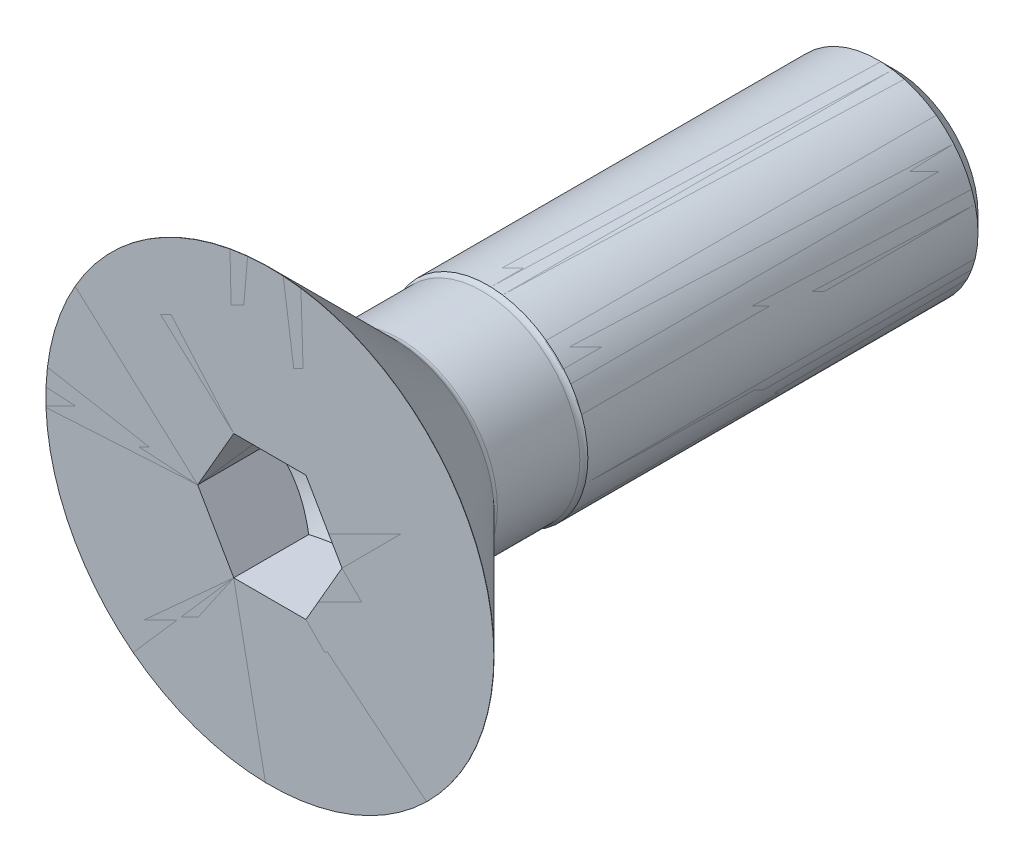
ISO-10303-21;
HEADER;
FILE_DESCRIPTION(('STEP AP214'),'2;1');
FILE_NAME('part.step','',(''),(''),'','','');
FILE_SCHEMA(('AUTOMOTIVE_DESIGN { 1 0 10303 214 1 1 1 1 }'));
ENDSEC;
DATA;
#1=APPLICATION_CONTEXT('core data for automotive mechanical design processes');
#2=APPLICATION_PROTOCOL_DEFINITION('international standard','automotive_design',2000,#1);
#3=PRODUCT_CONTEXT('',#1,'mechanical');
#4=PRODUCT('Part','Part','',(#3));
#5=PRODUCT_RELATED_PRODUCT_CATEGORY('part','',(#4));
#6=PRODUCT_DEFINITION_FORMATION('','',#4);
#7=PRODUCT_DEFINITION_CONTEXT('part definition',#1,'design');
#8=PRODUCT_DEFINITION('design','',#6,#7);
#9=PRODUCT_DEFINITION_SHAPE('','',#8);
#10=(LENGTH_UNIT() NAMED_UNIT(*) SI_UNIT(.MILLI.,.METRE.));
#11=(NAMED_UNIT(*) PLANE_ANGLE_UNIT() SI_UNIT($,.RADIAN.));
#12=(NAMED_UNIT(*) SI_UNIT($,.STERADIAN.) SOLID_ANGLE_UNIT());
#13=UNCERTAINTY_MEASURE_WITH_UNIT(LENGTH_MEASURE(1.E-05),#10,'distance_accuracy_value','');
#14=(GEOMETRIC_REPRESENTATION_CONTEXT(3) GLOBAL_UNCERTAINTY_ASSIGNED_CONTEXT((#13)) GLOBAL_UNIT_ASSIGNED_CONTEXT((#10,
#11,#12)) REPRESENTATION_CONTEXT('',''));
#15=CARTESIAN_POINT('',(0.,0.,0.));
#16=DIRECTION('',(0.,0.,1.));
#17=DIRECTION('',(1.,0.,0.));
#18=AXIS2_PLACEMENT_3D('',#15,#16,#17);
#19=CARTESIAN_POINT('',(0.,8.96,0.));
#20=DIRECTION('',(0.,0.,-1.));
#21=DIRECTION('',(-1.,0.,0.));
#22=AXIS2_PLACEMENT_3D('',#19,#20,#21);
#23=PLANE('',#22);
#24=CARTESIAN_POINT('',(0.,0.,0.));
#25=DIRECTION('',(0.,0.,1.));
#26=DIRECTION('',(1.,0.,0.));
#27=AXIS2_PLACEMENT_3D('',#24,#25,#26);
#28=CIRCLE('',#27,8.96);
#29=CARTESIAN_POINT('',(8.96,0.,0.));
#30=VERTEX_POINT('',#29);
#31=EDGE_CURVE('P0_E118',#30,#30,#28,.T.);
#32=ORIENTED_EDGE('',*,*,#31,.T.);
#33=EDGE_LOOP('',(#32));
#34=FACE_BOUND('',#33,.T.);
#35=DIRECTION('',(0.5,-0.866025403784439,0.));
#36=VECTOR('',#35,1.);
#37=CARTESIAN_POINT('',(1.443375,2.49999883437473,0.));
#38=LINE('',#37,#36);
#39=CARTESIAN_POINT('',(1.443375,2.49999883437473,0.));
#40=VERTEX_POINT('',#39);
#41=CARTESIAN_POINT('',(2.88675,0.,0.));
#42=VERTEX_POINT('',#41);
#43=EDGE_CURVE('P0_E42',#40,#42,#38,.T.);
#44=ORIENTED_EDGE('',*,*,#43,.T.);
#45=DIRECTION('',(-0.5,-0.866025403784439,0.));
#46=VECTOR('',#45,1.);
#47=CARTESIAN_POINT('',(2.88675,0.,0.));
#48=LINE('',#47,#46);
#49=CARTESIAN_POINT('',(1.443375,-2.49999883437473,0.));
#50=VERTEX_POINT('',#49);
#51=EDGE_CURVE('P0_E191',#42,#50,#48,.T.);
#52=ORIENTED_EDGE('',*,*,#51,.T.);
#53=DIRECTION('',(-1.,0.,0.));
#54=VECTOR('',#53,1.);
#55=CARTESIAN_POINT('',(1.443375,-2.49999883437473,0.));
#56=LINE('',#55,#54);
#57=CARTESIAN_POINT('',(-1.443375,-2.49999883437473,0.));
#58=VERTEX_POINT('',#57);
#59=EDGE_CURVE('P0_E242',#50,#58,#56,.T.);
#60=ORIENTED_EDGE('',*,*,#59,.T.);
#61=DIRECTION('',(-0.5,0.866025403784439,0.));
#62=VECTOR('',#61,1.);
#63=CARTESIAN_POINT('',(-1.443375,-2.49999883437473,0.));
#64=LINE('',#63,#62);
#65=CARTESIAN_POINT('',(-2.88675,0.,0.));
#66=VERTEX_POINT('',#65);
#67=EDGE_CURVE('P0_E240',#58,#66,#64,.T.);
#68=ORIENTED_EDGE('',*,*,#67,.T.);
#69=DIRECTION('',(0.5,0.866025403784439,0.));
#70=VECTOR('',#69,1.);
#71=CARTESIAN_POINT('',(-2.88675,0.,0.));
#72=LINE('',#71,#70);
#73=CARTESIAN_POINT('',(-1.443375,2.49999883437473,0.));
#74=VERTEX_POINT('',#73);
#75=EDGE_CURVE('P0_E107',#66,#74,#72,.T.);
#76=ORIENTED_EDGE('',*,*,#75,.T.);
#77=DIRECTION('',(1.,0.,0.));
#78=VECTOR('',#77,1.);
#79=CARTESIAN_POINT('',(-1.443375,2.49999883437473,0.));
#80=LINE('',#79,#78);
#81=EDGE_CURVE('P0_E103',#74,#40,#80,.T.);
#82=ORIENTED_EDGE('',*,*,#81,.T.);
#83=EDGE_LOOP('',(#44,#52,#60,#68,#76,#82));
#84=FACE_BOUND('',#83,.T.);
#85=ADVANCED_FACE('P0_F28',(#34,#84),#23,.F.);
#86=CARTESIAN_POINT('',(0.,0.,-25.));
#87=DIRECTION('',(0.,0.,1.));
#88=DIRECTION('',(1.,0.,0.));
#89=AXIS2_PLACEMENT_3D('',#86,#87,#88);
#90=PLANE('',#89);
#91=CARTESIAN_POINT('',(0.,0.,-25.));
#92=DIRECTION('',(0.,0.,1.));
#93=DIRECTION('',(1.,0.,0.));
#94=AXIS2_PLACEMENT_3D('',#91,#92,#93);
#95=CIRCLE('',#94,3.3234375);
#96=CARTESIAN_POINT('',(3.3234375,0.,-25.));
#97=VERTEX_POINT('',#96);
#98=EDGE_CURVE('P0_E11',#97,#97,#95,.T.);
#99=ORIENTED_EDGE('',*,*,#98,.F.);
#100=EDGE_LOOP('',(#99));
#101=FACE_BOUND('',#100,.T.);
#102=ADVANCED_FACE('P0_F143',(#101),#90,.F.);
#103=CARTESIAN_POINT('',(0.,0.,-25.));
#104=DIRECTION('',(0.,0.,1.));
#105=DIRECTION('',(1.,0.,0.));
#106=AXIS2_PLACEMENT_3D('',#103,#104,#105);
#107=CONICAL_SURFACE('',#106,3.3234375,0.785398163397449);
#108=CARTESIAN_POINT('',(0.,0.,-24.3234375));
#109=DIRECTION('',(0.,0.,1.));
#110=DIRECTION('',(1.,0.,0.));
#111=AXIS2_PLACEMENT_3D('',#108,#109,#110);
#112=CIRCLE('',#111,4.);
#113=CARTESIAN_POINT('',(4.,0.,-24.3234375));
#114=VERTEX_POINT('',#113);
#115=EDGE_CURVE('P0_E35',#114,#114,#112,.T.);
#116=ORIENTED_EDGE('',*,*,#115,.F.);
#117=EDGE_LOOP('',(#116));
#118=FACE_BOUND('',#117,.T.);
#119=ORIENTED_EDGE('',*,*,#98,.T.);
#120=EDGE_LOOP('',(#119));
#121=FACE_BOUND('',#120,.T.);
#122=ADVANCED_FACE('P0_F140',(#118,#121),#107,.T.);
#123=CARTESIAN_POINT('',(0.,0.,0.));
#124=DIRECTION('',(0.,0.,1.));
#125=DIRECTION('',(1.,0.,0.));
#126=AXIS2_PLACEMENT_3D('',#123,#124,#125);
#127=CYLINDRICAL_SURFACE('',#126,4.);
#128=CARTESIAN_POINT('',(0.,0.,-8.72));
#129=DIRECTION('',(0.,0.,1.));
#130=DIRECTION('',(1.,0.,0.));
#131=AXIS2_PLACEMENT_3D('',#128,#129,#130);
#132=CIRCLE('',#131,4.);
#133=CARTESIAN_POINT('',(4.,0.,-8.72));
#134=VERTEX_POINT('',#133);
#135=EDGE_CURVE('P0_E133',#134,#134,#132,.T.);
#136=ORIENTED_EDGE('',*,*,#135,.F.);
#137=EDGE_LOOP('',(#136));
#138=FACE_BOUND('',#137,.T.);
#139=ORIENTED_EDGE('',*,*,#115,.T.);
#140=EDGE_LOOP('',(#139));
#141=FACE_BOUND('',#140,.T.);
#142=ADVANCED_FACE('P0_F138',(#138,#141),#127,.T.);
#143=CARTESIAN_POINT('',(0.,0.,-8.49372583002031));
#144=DIRECTION('',(0.,0.,1.));
#145=DIRECTION('',(1.,0.,0.));
#146=AXIS2_PLACEMENT_3D('',#143,#144,#145);
#147=TOROIDAL_SURFACE('',#146,4.2262741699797,0.32);
#148=ORIENTED_EDGE('',*,*,#135,.T.);
#149=EDGE_LOOP('',(#148));
#150=FACE_BOUND('',#149,.T.);
#151=CARTESIAN_POINT('',(0.,0.,-8.49372583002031));
#152=DIRECTION('',(0.,0.,1.));
#153=DIRECTION('',(1.,0.,0.));
#154=AXIS2_PLACEMENT_3D('',#151,#152,#153);
#155=CIRCLE('',#154,3.9062741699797);
#156=CARTESIAN_POINT('',(3.9062741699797,0.,-8.49372583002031));
#157=VERTEX_POINT('',#156);
#158=EDGE_CURVE('P0_E130',#157,#157,#155,.T.);
#159=ORIENTED_EDGE('',*,*,#158,.F.);
#160=EDGE_LOOP('',(#159));
#161=FACE_BOUND('',#160,.T.);
#162=ADVANCED_FACE('P0_F155',(#150,#161),#147,.F.);
#163=CARTESIAN_POINT('',(0.,0.,0.));
#164=DIRECTION('',(0.,0.,1.));
#165=DIRECTION('',(1.,0.,0.));
#166=AXIS2_PLACEMENT_3D('',#163,#164,#165);
#167=CYLINDRICAL_SURFACE('',#166,3.9062741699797);
#168=CARTESIAN_POINT('',(0.,0.,-5.19627416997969));
#169=DIRECTION('',(0.,0.,1.));
#170=DIRECTION('',(1.,0.,0.));
#171=AXIS2_PLACEMENT_3D('',#168,#169,#170);
#172=CIRCLE('',#171,3.9062741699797);
#173=CARTESIAN_POINT('',(3.9062741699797,0.,-5.19627416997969));
#174=VERTEX_POINT('',#173);
#175=EDGE_CURVE('P0_E127',#174,#174,#172,.T.);
#176=ORIENTED_EDGE('',*,*,#175,.F.);
#177=EDGE_LOOP('',(#176));
#178=FACE_BOUND('',#177,.T.);
#179=ORIENTED_EDGE('',*,*,#158,.T.);
#180=EDGE_LOOP('',(#179));
#181=FACE_BOUND('',#180,.T.);
#182=ADVANCED_FACE('P0_F159',(#178,#181),#167,.T.);
#183=CARTESIAN_POINT('',(0.,0.,-5.19627416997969));
#184=DIRECTION('',(0.,0.,1.));
#185=DIRECTION('',(1.,0.,0.));
#186=AXIS2_PLACEMENT_3D('',#183,#184,#185);
#187=TOROIDAL_SURFACE('',#186,4.22627416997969,0.32);
#188=ORIENTED_EDGE('',*,*,#175,.T.);
#189=EDGE_LOOP('',(#188));
#190=FACE_BOUND('',#189,.T.);
#191=CARTESIAN_POINT('',(0.,0.,-4.97));
#192=DIRECTION('',(0.,0.,1.));
#193=DIRECTION('',(1.,0.,0.));
#194=AXIS2_PLACEMENT_3D('',#191,#192,#193);
#195=CIRCLE('',#194,4.);
#196=CARTESIAN_POINT('',(4.,0.,-4.97));
#197=VERTEX_POINT('',#196);
#198=EDGE_CURVE('P0_E124',#197,#197,#195,.T.);
#199=ORIENTED_EDGE('',*,*,#198,.F.);
#200=EDGE_LOOP('',(#199));
#201=FACE_BOUND('',#200,.T.);
#202=ADVANCED_FACE('P0_F163',(#190,#201),#187,.F.);
#203=CARTESIAN_POINT('',(0.,0.,-4.97));
#204=DIRECTION('',(0.,0.,1.));
#205=DIRECTION('',(1.,0.,0.));
#206=AXIS2_PLACEMENT_3D('',#203,#204,#205);
#207=CONICAL_SURFACE('',#206,4.,0.785398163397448);
#208=CARTESIAN_POINT('',(0.,0.,-0.0099999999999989));
#209=DIRECTION('',(0.,0.,1.));
#210=DIRECTION('',(1.,0.,0.));
#211=AXIS2_PLACEMENT_3D('',#208,#209,#210);
#212=CIRCLE('',#211,8.96);
#213=CARTESIAN_POINT('',(8.96,0.,-0.00999999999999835));
#214=VERTEX_POINT('',#213);
#215=EDGE_CURVE('P0_E121',#214,#214,#212,.T.);
#216=ORIENTED_EDGE('',*,*,#215,.F.);
#217=EDGE_LOOP('',(#216));
#218=FACE_BOUND('',#217,.T.);
#219=ORIENTED_EDGE('',*,*,#198,.T.);
#220=EDGE_LOOP('',(#219));
#221=FACE_BOUND('',#220,.T.);
#222=ADVANCED_FACE('P0_F167',(#218,#221),#207,.T.);
#223=CARTESIAN_POINT('',(0.,0.,0.));
#224=DIRECTION('',(0.,0.,1.));
#225=DIRECTION('',(1.,0.,0.));
#226=AXIS2_PLACEMENT_3D('',#223,#224,#225);
#227=CYLINDRICAL_SURFACE('',#226,8.96);
#228=ORIENTED_EDGE('',*,*,#31,.F.);
#229=EDGE_LOOP('',(#228));
#230=FACE_BOUND('',#229,.T.);
#231=ORIENTED_EDGE('',*,*,#215,.T.);
#232=EDGE_LOOP('',(#231));
#233=FACE_BOUND('',#232,.T.);
#234=ADVANCED_FACE('P0_F171',(#230,#233),#227,.T.);
#235=CARTESIAN_POINT('',(1.443375,2.49999883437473,-4.66666588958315));
#236=DIRECTION('',(-0.866025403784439,-0.5,0.));
#237=DIRECTION('',(-0.5,0.866025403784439,0.));
#238=AXIS2_PLACEMENT_3D('',#235,#236,#237);
#239=PLANE('',#238);
#240=DIRECTION('',(0.,0.,1.));
#241=VECTOR('',#240,1.);
#242=CARTESIAN_POINT('',(2.88675,0.,-4.66666588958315));
#243=LINE('',#242,#241);
#244=CARTESIAN_POINT('',(2.88675,0.,-3.));
#245=VERTEX_POINT('',#244);
#246=EDGE_CURVE('P0_E116',#245,#42,#243,.T.);
#247=ORIENTED_EDGE('',*,*,#246,.T.);
#248=ORIENTED_EDGE('',*,*,#43,.F.);
#249=DIRECTION('',(0.,0.,1.));
#250=VECTOR('',#249,1.);
#251=CARTESIAN_POINT('',(1.443375,2.49999883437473,-4.66666588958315));
#252=LINE('',#251,#250);
#253=CARTESIAN_POINT('',(1.443375,2.49999883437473,-3.));
#254=VERTEX_POINT('',#253);
#255=EDGE_CURVE('P0_E97',#254,#40,#252,.T.);
#256=ORIENTED_EDGE('',*,*,#255,.F.);
#257=CARTESIAN_POINT('',(2.88675011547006,-1.99999999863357E-07,-2.99999993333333));
#258=CARTESIAN_POINT('',(2.82332252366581,0.10985961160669,-3.03663049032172));
#259=CARTESIAN_POINT('',(2.75934742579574,0.220667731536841,-3.06994406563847));
#260=CARTESIAN_POINT('',(2.63028954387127,0.444202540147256,-3.12809191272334));
#261=CARTESIAN_POINT('',(2.56520446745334,0.556933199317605,-3.15290561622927));
#262=CARTESIAN_POINT('',(2.43584088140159,0.780997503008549,-3.19152993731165));
#263=CARTESIAN_POINT('',(2.37158227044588,0.892296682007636,-3.20559765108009));
#264=CARTESIAN_POINT('',(2.24276284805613,1.11541846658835,-3.22238842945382));
#265=CARTESIAN_POINT('',(2.17820250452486,1.22724026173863,-3.22512540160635));
#266=CARTESIAN_POINT('',(2.05757841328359,1.43616731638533,-3.21941704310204));
#267=CARTESIAN_POINT('',(2.00149656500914,1.53330392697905,-3.2123733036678));
#268=CARTESIAN_POINT('',(1.8896982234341,1.72694433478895,-3.19005329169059));
#269=CARTESIAN_POINT('',(1.83398211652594,1.82344746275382,-3.17476940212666));
#270=CARTESIAN_POINT('',(1.72195345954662,2.01748678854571,-3.13656263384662));
#271=CARTESIAN_POINT('',(1.66565508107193,2.11499844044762,-3.11347787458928));
#272=CARTESIAN_POINT('',(1.55389777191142,2.3085677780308,-3.06108522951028));
#273=CARTESIAN_POINT('',(1.49843741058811,2.40462794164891,-3.03178964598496));
#274=CARTESIAN_POINT('',(1.44337488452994,2.49999903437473,-2.99999993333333));
#275=B_SPLINE_CURVE_WITH_KNOTS('',3,(#257,#258,#259,#260,#261,#262,#263,#264,#265,#266,#267,
#268,#269,#270,#271,#272,#273,#274),.UNSPECIFIED.,.F.,.F.,(4,2,2,2,2,2,2,2,4),(0.,
0.396269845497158,0.793491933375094,1.18088400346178,1.56780044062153,1.90463400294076,
2.24177946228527,2.58640119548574,2.93034658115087),.UNSPECIFIED.);
#276=EDGE_CURVE('P0_E90',#245,#254,#275,.T.);
#277=ORIENTED_EDGE('',*,*,#276,.F.);
#278=EDGE_LOOP('',(#247,#248,#256,#277));
#279=FACE_BOUND('',#278,.T.);
#280=ADVANCED_FACE('P0_F98',(#279),#239,.T.);
#281=CARTESIAN_POINT('',(2.88675,0.,-4.66666588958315));
#282=DIRECTION('',(-0.866025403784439,0.5,0.));
#283=DIRECTION('',(0.5,0.866025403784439,0.));
#284=AXIS2_PLACEMENT_3D('',#281,#282,#283);
#285=PLANE('',#284);
#286=DIRECTION('',(0.,0.,1.));
#287=VECTOR('',#286,1.);
#288=CARTESIAN_POINT('',(1.443375,-2.49999883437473,-4.66666588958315));
#289=LINE('',#288,#287);
#290=CARTESIAN_POINT('',(1.443375,-2.49999883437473,-3.));
#291=VERTEX_POINT('',#290);
#292=EDGE_CURVE('P0_E114',#291,#50,#289,.T.);
#293=ORIENTED_EDGE('',*,*,#292,.T.);
#294=ORIENTED_EDGE('',*,*,#51,.F.);
#295=ORIENTED_EDGE('',*,*,#246,.F.);
#296=CARTESIAN_POINT('',(1.44337488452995,-2.49999903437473,-2.99999993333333));
#297=CARTESIAN_POINT('',(1.50680247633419,-2.39013922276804,-3.03663049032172));
#298=CARTESIAN_POINT('',(1.57077757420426,-2.27933110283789,-3.06994406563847));
#299=CARTESIAN_POINT('',(1.69983545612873,-2.05579629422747,-3.12809191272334));
#300=CARTESIAN_POINT('',(1.76492053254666,-1.94306563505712,-3.15290561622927));
#301=CARTESIAN_POINT('',(1.89428411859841,-1.71900133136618,-3.19152993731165));
#302=CARTESIAN_POINT('',(1.95854272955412,-1.60770215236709,-3.20559765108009));
#303=CARTESIAN_POINT('',(2.08736215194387,-1.38458036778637,-3.22238842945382));
#304=CARTESIAN_POINT('',(2.15192249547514,-1.2727585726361,-3.22512540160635));
#305=CARTESIAN_POINT('',(2.27254658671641,-1.06383151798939,-3.21941704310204));
#306=CARTESIAN_POINT('',(2.32862843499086,-0.966694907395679,-3.2123733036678));
#307=CARTESIAN_POINT('',(2.4404267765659,-0.77305449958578,-3.19005329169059));
#308=CARTESIAN_POINT('',(2.49614288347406,-0.676551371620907,-3.17476940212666));
#309=CARTESIAN_POINT('',(2.60817154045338,-0.48251204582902,-3.13656263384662));
#310=CARTESIAN_POINT('',(2.66446991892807,-0.385000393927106,-3.11347787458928));
#311=CARTESIAN_POINT('',(2.77622722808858,-0.191431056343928,-3.06108522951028));
#312=CARTESIAN_POINT('',(2.83168758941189,-0.0953708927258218,-3.03178964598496));
#313=CARTESIAN_POINT('',(2.88675011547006,1.99999999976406E-07,-2.99999993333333));
#314=B_SPLINE_CURVE_WITH_KNOTS('',3,(#296,#297,#298,#299,#300,#301,#302,#303,#304,#305,#306,
#307,#308,#309,#310,#311,#312,#313),.UNSPECIFIED.,.F.,.F.,(4,2,2,2,2,2,2,2,4),(0.,
0.396269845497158,0.793491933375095,1.18088400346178,1.56780044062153,1.90463400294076,
2.24177946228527,2.58640119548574,2.93034658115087),.UNSPECIFIED.);
#315=EDGE_CURVE('P0_E94',#291,#245,#314,.T.);
#316=ORIENTED_EDGE('',*,*,#315,.F.);
#317=EDGE_LOOP('',(#293,#294,#295,#316));
#318=FACE_BOUND('',#317,.T.);
#319=ADVANCED_FACE('P0_F179',(#318),#285,.T.);
#320=CARTESIAN_POINT('',(1.443375,-2.49999883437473,-4.66666588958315));
#321=DIRECTION('',(0.,1.,0.));
#322=DIRECTION('',(1.,0.,0.));
#323=AXIS2_PLACEMENT_3D('',#320,#321,#322);
#324=PLANE('',#323);
#325=DIRECTION('',(0.,0.,1.));
#326=VECTOR('',#325,1.);
#327=CARTESIAN_POINT('',(-1.443375,-2.49999883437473,-4.66666588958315));
#328=LINE('',#327,#326);
#329=CARTESIAN_POINT('',(-1.443375,-2.49999883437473,-3.));
#330=VERTEX_POINT('',#329);
#331=EDGE_CURVE('P0_E112',#330,#58,#328,.T.);
#332=ORIENTED_EDGE('',*,*,#331,.T.);
#333=ORIENTED_EDGE('',*,*,#59,.F.);
#334=ORIENTED_EDGE('',*,*,#292,.F.);
#335=CARTESIAN_POINT('',(-3.73786106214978,-2.49999883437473,-2.07041221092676));
#336=CARTESIAN_POINT('',(-3.62990250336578,-2.49999883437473,-2.12220664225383));
#337=CARTESIAN_POINT('',(-3.52168094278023,-2.49999883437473,-2.17346309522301));
#338=CARTESIAN_POINT('',(-3.30457164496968,-2.49999883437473,-2.27459485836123));
#339=CARTESIAN_POINT('',(-3.1956837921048,-2.49999883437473,-2.32446991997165));
#340=CARTESIAN_POINT('',(-2.97647740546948,-2.49999883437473,-2.42281234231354));
#341=CARTESIAN_POINT('',(-2.86615419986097,-2.49999883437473,-2.4712693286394));
#342=CARTESIAN_POINT('',(-2.64458202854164,-2.49999883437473,-2.56601036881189));
#343=CARTESIAN_POINT('',(-2.5333331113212,-2.49999883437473,-2.61229453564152));
#344=CARTESIAN_POINT('',(-2.30680205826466,-2.49999883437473,-2.70328992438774));
#345=CARTESIAN_POINT('',(-2.19149052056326,-2.49999883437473,-2.74792838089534));
#346=CARTESIAN_POINT('',(-1.95947266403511,-2.49999883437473,-2.83349401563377));
#347=CARTESIAN_POINT('',(-1.84276618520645,-2.49999883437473,-2.87442076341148));
#348=CARTESIAN_POINT('',(-1.60804233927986,-2.49999883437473,-2.95139260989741));
#349=CARTESIAN_POINT('',(-1.49002871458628,-2.49999883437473,-2.98744899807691));
#350=CARTESIAN_POINT('',(-1.25231014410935,-2.49999883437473,-3.05344705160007));
#351=CARTESIAN_POINT('',(-1.13260562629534,-2.49999883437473,-3.08339023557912));
#352=CARTESIAN_POINT('',(-0.891754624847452,-2.49999883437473,-3.13556568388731));
#353=CARTESIAN_POINT('',(-0.770611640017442,-2.49999883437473,-3.15781378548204));
#354=CARTESIAN_POINT('',(-0.526970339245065,-2.49999883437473,-3.19314222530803));
#355=CARTESIAN_POINT('',(-0.404472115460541,-2.49999883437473,-3.20622318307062));
#356=CARTESIAN_POINT('',(-0.160266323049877,-2.49999883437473,-3.22200367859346));
#357=CARTESIAN_POINT('',(-0.0385668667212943,-2.49999883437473,-3.2248257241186));
#358=CARTESIAN_POINT('',(0.204641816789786,-2.49999883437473,-3.22016410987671));
#359=CARTESIAN_POINT('',(0.326151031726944,-2.49999883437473,-3.21267981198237));
#360=CARTESIAN_POINT('',(0.536550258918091,-2.49999883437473,-3.19130128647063));
#361=CARTESIAN_POINT('',(0.62567290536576,-2.49999883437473,-3.17959110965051));
#362=CARTESIAN_POINT('',(0.803172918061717,-2.49999883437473,-3.15143172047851));
#363=CARTESIAN_POINT('',(0.891550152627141,-2.49999883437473,-3.13498168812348));
#364=CARTESIAN_POINT('',(1.15551819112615,-2.49999883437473,-3.07939182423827));
#365=CARTESIAN_POINT('',(1.32980784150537,-2.49999883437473,-3.03402791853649));
#366=CARTESIAN_POINT('',(1.59042319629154,-2.49999883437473,-2.95652590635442));
#367=CARTESIAN_POINT('',(1.67812270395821,-2.49999883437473,-2.92875434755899));
#368=CARTESIAN_POINT('',(1.85261386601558,-2.49999883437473,-2.87064301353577));
#369=CARTESIAN_POINT('',(1.93940604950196,-2.49999883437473,-2.84030484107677));
#370=CARTESIAN_POINT('',(2.11219208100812,-2.49999883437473,-2.77749987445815));
#371=CARTESIAN_POINT('',(2.19818607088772,-2.49999883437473,-2.74503346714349));
#372=CARTESIAN_POINT('',(2.36949689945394,-2.49999883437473,-2.67832369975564));
#373=CARTESIAN_POINT('',(2.45481362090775,-2.49999883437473,-2.6440800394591));
#374=CARTESIAN_POINT('',(2.67258663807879,-2.49999883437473,-2.55447752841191));
#375=CARTESIAN_POINT('',(2.80460718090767,-2.49999883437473,-2.49806097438));
#376=CARTESIAN_POINT('',(3.06745885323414,-2.49999883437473,-2.38251374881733));
#377=CARTESIAN_POINT('',(3.19828989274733,-2.49999883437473,-2.32338287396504));
#378=CARTESIAN_POINT('',(3.45900849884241,-2.49999883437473,-2.20302339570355));
#379=CARTESIAN_POINT('',(3.58889589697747,-2.49999883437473,-2.14179442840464));
#380=CARTESIAN_POINT('',(3.84788845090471,-2.49999883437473,-2.01770131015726));
#381=CARTESIAN_POINT('',(3.97699358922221,-2.49999883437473,-1.95483712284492));
#382=CARTESIAN_POINT('',(4.36366789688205,-2.49999883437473,-1.7641683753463));
#383=CARTESIAN_POINT('',(4.62028438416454,-2.49999883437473,-1.63443362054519));
#384=CARTESIAN_POINT('',(5.1317603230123,-2.49999883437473,-1.37164618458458));
#385=CARTESIAN_POINT('',(5.38661999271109,-2.49999883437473,-1.23859392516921));
#386=CARTESIAN_POINT('',(5.87112445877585,-2.49999883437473,-0.982853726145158));
#387=CARTESIAN_POINT('',(6.10087872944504,-2.49999883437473,-0.860372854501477));
#388=CARTESIAN_POINT('',(6.55964828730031,-2.49999883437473,-0.614016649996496));
#389=CARTESIAN_POINT('',(6.78866354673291,-2.49999883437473,-0.490141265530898));
#390=CARTESIAN_POINT('',(7.24554286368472,-2.49999883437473,-0.241661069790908));
#391=CARTESIAN_POINT('',(7.47340836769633,-2.49999883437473,-0.117058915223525));
#392=CARTESIAN_POINT('',(7.92867868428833,-2.49999883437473,0.132956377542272));
#393=CARTESIAN_POINT('',(8.15608352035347,-2.49999883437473,0.258369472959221));
#394=CARTESIAN_POINT('',(8.38332285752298,-2.49999883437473,0.384079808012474));
#395=B_SPLINE_CURVE_WITH_KNOTS('',3,(#335,#336,#337,#338,#339,#340,#341,#342,#343,#344,#345,
#346,#347,#348,#349,#350,#351,#352,#353,#354,#355,#356,#357,#358,#359,#360,#361,#362,#363,#364,
#365,#366,#367,#368,#369,#370,#371,#372,#373,#374,#375,#376,#377,#378,#379,#380,#381,#382,#383,
#384,#385,#386,#387,#388,#389,#390,#391,#392,#393,#394),.UNSPECIFIED.,.F.,.F.,(4,2,2,2,2,2,2,2,
2,2,2,2,2,2,2,2,2,2,2,2,2,2,2,2,2,2,2,2,2,4),(0.,0.359225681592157,0.718515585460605,
1.07998495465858,1.44143550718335,1.81233642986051,2.18328031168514,2.55334902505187,
2.92332569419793,3.29253631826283,3.66172198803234,4.02648423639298,4.39126907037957,
4.66080188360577,4.93038135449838,5.46995360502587,5.74590907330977,6.02169347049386,
6.29742787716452,6.5732090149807,7.00387398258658,7.43457126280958,7.86534362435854,
8.29612557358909,9.15872149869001,10.0212083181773,10.8022890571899,11.583398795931,
12.3625217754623,13.1416039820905),.UNSPECIFIED.);
#396=EDGE_CURVE('P0_E216',#330,#291,#395,.T.);
#397=ORIENTED_EDGE('',*,*,#396,.F.);
#398=EDGE_LOOP('',(#332,#333,#334,#397));
#399=FACE_BOUND('',#398,.T.);
#400=ADVANCED_FACE('P0_F220',(#399),#324,.T.);
#401=CARTESIAN_POINT('',(-1.443375,-2.49999883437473,-4.66666588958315));
#402=DIRECTION('',(0.866025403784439,0.5,0.));
#403=DIRECTION('',(0.5,-0.866025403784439,0.));
#404=AXIS2_PLACEMENT_3D('',#401,#402,#403);
#405=PLANE('',#404);
#406=DIRECTION('',(0.,0.,1.));
#407=VECTOR('',#406,1.);
#408=CARTESIAN_POINT('',(-2.88675,0.,-4.66666588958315));
#409=LINE('',#408,#407);
#410=CARTESIAN_POINT('',(-2.88675,0.,-3.));
#411=VERTEX_POINT('',#410);
#412=EDGE_CURVE('P0_E105',#411,#66,#409,.T.);
#413=ORIENTED_EDGE('',*,*,#412,.T.);
#414=ORIENTED_EDGE('',*,*,#67,.F.);
#415=ORIENTED_EDGE('',*,*,#331,.F.);
#416=CARTESIAN_POINT('',(-2.88675011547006,2.E-07,-2.99999993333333));
#417=CARTESIAN_POINT('',(-2.82332252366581,-0.10985961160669,-3.03663049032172));
#418=CARTESIAN_POINT('',(-2.75934742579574,-0.220667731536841,-3.06994406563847));
#419=CARTESIAN_POINT('',(-2.63028954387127,-0.444202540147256,-3.12809191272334));
#420=CARTESIAN_POINT('',(-2.56520446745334,-0.556933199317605,-3.15290561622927));
#421=CARTESIAN_POINT('',(-2.43584088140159,-0.78099750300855,-3.19152993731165));
#422=CARTESIAN_POINT('',(-2.37158227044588,-0.892296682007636,-3.20559765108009));
#423=CARTESIAN_POINT('',(-2.24276284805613,-1.11541846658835,-3.22238842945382));
#424=CARTESIAN_POINT('',(-2.17820250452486,-1.22724026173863,-3.22512540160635));
#425=CARTESIAN_POINT('',(-2.05757841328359,-1.43616731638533,-3.21941704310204));
#426=CARTESIAN_POINT('',(-2.00149656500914,-1.53330392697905,-3.2123733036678));
#427=CARTESIAN_POINT('',(-1.8896982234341,-1.72694433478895,-3.19005329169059));
#428=CARTESIAN_POINT('',(-1.83398211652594,-1.82344746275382,-3.17476940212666));
#429=CARTESIAN_POINT('',(-1.72195345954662,-2.01748678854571,-3.13656263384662));
#430=CARTESIAN_POINT('',(-1.66565508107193,-2.11499844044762,-3.11347787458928));
#431=CARTESIAN_POINT('',(-1.55389777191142,-2.3085677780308,-3.06108522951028));
#432=CARTESIAN_POINT('',(-1.49843741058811,-2.40462794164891,-3.03178964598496));
#433=CARTESIAN_POINT('',(-1.44337488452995,-2.49999903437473,-2.99999993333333));
#434=B_SPLINE_CURVE_WITH_KNOTS('',3,(#416,#417,#418,#419,#420,#421,#422,#423,#424,#425,#426,
#427,#428,#429,#430,#431,#432,#433),.UNSPECIFIED.,.F.,.F.,(4,2,2,2,2,2,2,2,4),(0.,
0.396269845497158,0.793491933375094,1.18088400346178,1.56780044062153,1.90463400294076,
2.24177946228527,2.58640119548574,2.93034658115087),.UNSPECIFIED.);
#435=EDGE_CURVE('P0_E211',#411,#330,#434,.T.);
#436=ORIENTED_EDGE('',*,*,#435,.F.);
#437=EDGE_LOOP('',(#413,#414,#415,#436));
#438=FACE_BOUND('',#437,.T.);
#439=ADVANCED_FACE('P0_F223',(#438),#405,.T.);
#440=CARTESIAN_POINT('',(-2.88675,0.,-4.66666588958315));
#441=DIRECTION('',(0.866025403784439,-0.5,0.));
#442=DIRECTION('',(-0.5,-0.866025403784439,0.));
#443=AXIS2_PLACEMENT_3D('',#440,#441,#442);
#444=PLANE('',#443);
#445=DIRECTION('',(0.,0.,1.));
#446=VECTOR('',#445,1.);
#447=CARTESIAN_POINT('',(-1.443375,2.49999883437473,-4.66666588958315));
#448=LINE('',#447,#446);
#449=CARTESIAN_POINT('',(-1.443375,2.49999883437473,-3.));
#450=VERTEX_POINT('',#449);
#451=EDGE_CURVE('P0_E102',#450,#74,#448,.T.);
#452=ORIENTED_EDGE('',*,*,#451,.T.);
#453=ORIENTED_EDGE('',*,*,#75,.F.);
#454=ORIENTED_EDGE('',*,*,#412,.F.);
#455=CARTESIAN_POINT('',(-1.44337488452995,2.49999903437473,-2.99999993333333));
#456=CARTESIAN_POINT('',(-1.50680247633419,2.39013922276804,-3.03663049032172));
#457=CARTESIAN_POINT('',(-1.57077757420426,2.27933110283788,-3.06994406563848));
#458=CARTESIAN_POINT('',(-1.69983545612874,2.05579629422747,-3.12809191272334));
#459=CARTESIAN_POINT('',(-1.76492053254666,1.94306563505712,-3.15290561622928));
#460=CARTESIAN_POINT('',(-1.89428411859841,1.71900133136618,-3.19152993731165));
#461=CARTESIAN_POINT('',(-1.95854272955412,1.60770215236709,-3.20559765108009));
#462=CARTESIAN_POINT('',(-2.08736215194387,1.38458036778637,-3.22238842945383));
#463=CARTESIAN_POINT('',(-2.15192249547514,1.2727585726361,-3.22512540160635));
#464=CARTESIAN_POINT('',(-2.27254658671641,1.06383151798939,-3.21941704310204));
#465=CARTESIAN_POINT('',(-2.32862843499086,0.966694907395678,-3.2123733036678));
#466=CARTESIAN_POINT('',(-2.4404267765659,0.773054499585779,-3.19005329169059));
#467=CARTESIAN_POINT('',(-2.49614288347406,0.676551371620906,-3.17476940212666));
#468=CARTESIAN_POINT('',(-2.60817154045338,0.48251204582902,-3.13656263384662));
#469=CARTESIAN_POINT('',(-2.66446991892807,0.385000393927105,-3.11347787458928));
#470=CARTESIAN_POINT('',(-2.77622722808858,0.191431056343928,-3.06108522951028));
#471=CARTESIAN_POINT('',(-2.83168758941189,0.0953708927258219,-3.03178964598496));
#472=CARTESIAN_POINT('',(-2.88675011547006,-2.00000000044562E-07,-2.99999993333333));
#473=B_SPLINE_CURVE_WITH_KNOTS('',3,(#455,#456,#457,#458,#459,#460,#461,#462,#463,#464,#465,
#466,#467,#468,#469,#470,#471,#472),.UNSPECIFIED.,.F.,.F.,(4,2,2,2,2,2,2,2,4),(0.,
0.396269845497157,0.793491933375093,1.18088400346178,1.56780044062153,1.90463400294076,
2.24177946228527,2.58640119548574,2.93034658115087),.UNSPECIFIED.);
#474=EDGE_CURVE('P0_E50',#450,#411,#473,.T.);
#475=ORIENTED_EDGE('',*,*,#474,.F.);
#476=EDGE_LOOP('',(#452,#453,#454,#475));
#477=FACE_BOUND('',#476,.T.);
#478=ADVANCED_FACE('P0_F227',(#477),#444,.T.);
#479=CARTESIAN_POINT('',(-1.443375,2.49999883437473,-4.66666588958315));
#480=DIRECTION('',(0.,-1.,0.));
#481=DIRECTION('',(-1.,0.,0.));
#482=AXIS2_PLACEMENT_3D('',#479,#480,#481);
#483=PLANE('',#482);
#484=ORIENTED_EDGE('',*,*,#255,.T.);
#485=ORIENTED_EDGE('',*,*,#81,.F.);
#486=ORIENTED_EDGE('',*,*,#451,.F.);
#487=CARTESIAN_POINT('',(-3.73786106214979,2.49999883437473,-2.07041221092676));
#488=CARTESIAN_POINT('',(-3.62990250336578,2.49999883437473,-2.12220664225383));
#489=CARTESIAN_POINT('',(-3.52168094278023,2.49999883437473,-2.17346309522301));
#490=CARTESIAN_POINT('',(-3.30457164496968,2.49999883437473,-2.27459485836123));
#491=CARTESIAN_POINT('',(-3.1956837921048,2.49999883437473,-2.32446991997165));
#492=CARTESIAN_POINT('',(-2.97647740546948,2.49999883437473,-2.42281234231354));
#493=CARTESIAN_POINT('',(-2.86615419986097,2.49999883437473,-2.4712693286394));
#494=CARTESIAN_POINT('',(-2.64458202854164,2.49999883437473,-2.56601036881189));
#495=CARTESIAN_POINT('',(-2.53333311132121,2.49999883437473,-2.61229453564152));
#496=CARTESIAN_POINT('',(-2.30680205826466,2.49999883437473,-2.70328992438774));
#497=CARTESIAN_POINT('',(-2.19149052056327,2.49999883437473,-2.74792838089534));
#498=CARTESIAN_POINT('',(-1.95947266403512,2.49999883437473,-2.83349401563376));
#499=CARTESIAN_POINT('',(-1.84276618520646,2.49999883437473,-2.87442076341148));
#500=CARTESIAN_POINT('',(-1.60804233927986,2.49999883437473,-2.95139260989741));
#501=CARTESIAN_POINT('',(-1.49002871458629,2.49999883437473,-2.98744899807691));
#502=CARTESIAN_POINT('',(-1.25231014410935,2.49999883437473,-3.05344705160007));
#503=CARTESIAN_POINT('',(-1.13260562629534,2.49999883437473,-3.08339023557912));
#504=CARTESIAN_POINT('',(-0.891754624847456,2.49999883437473,-3.13556568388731));
#505=CARTESIAN_POINT('',(-0.770611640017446,2.49999883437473,-3.15781378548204));
#506=CARTESIAN_POINT('',(-0.526970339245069,2.49999883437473,-3.19314222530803));
#507=CARTESIAN_POINT('',(-0.404472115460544,2.49999883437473,-3.20622318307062));
#508=CARTESIAN_POINT('',(-0.160266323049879,2.49999883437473,-3.22200367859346));
#509=CARTESIAN_POINT('',(-0.0385668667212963,2.49999883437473,-3.2248257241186));
#510=CARTESIAN_POINT('',(0.204641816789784,2.49999883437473,-3.22016410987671));
#511=CARTESIAN_POINT('',(0.326151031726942,2.49999883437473,-3.21267981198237));
#512=CARTESIAN_POINT('',(0.536550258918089,2.49999883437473,-3.19130128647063));
#513=CARTESIAN_POINT('',(0.625672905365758,2.49999883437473,-3.17959110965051));
#514=CARTESIAN_POINT('',(0.803172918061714,2.49999883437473,-3.15143172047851));
#515=CARTESIAN_POINT('',(0.891550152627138,2.49999883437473,-3.13498168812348));
#516=CARTESIAN_POINT('',(1.15551819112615,2.49999883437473,-3.07939182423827));
#517=CARTESIAN_POINT('',(1.32980784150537,2.49999883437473,-3.03402791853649));
#518=CARTESIAN_POINT('',(1.59042319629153,2.49999883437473,-2.95652590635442));
#519=CARTESIAN_POINT('',(1.67812270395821,2.49999883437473,-2.92875434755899));
#520=CARTESIAN_POINT('',(1.85261386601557,2.49999883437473,-2.87064301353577));
#521=CARTESIAN_POINT('',(1.93940604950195,2.49999883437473,-2.84030484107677));
#522=CARTESIAN_POINT('',(2.11219208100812,2.49999883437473,-2.77749987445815));
#523=CARTESIAN_POINT('',(2.19818607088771,2.49999883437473,-2.74503346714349));
#524=CARTESIAN_POINT('',(2.36949689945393,2.49999883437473,-2.67832369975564));
#525=CARTESIAN_POINT('',(2.45481362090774,2.49999883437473,-2.6440800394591));
#526=CARTESIAN_POINT('',(2.67258663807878,2.49999883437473,-2.55447752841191));
#527=CARTESIAN_POINT('',(2.80460718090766,2.49999883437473,-2.49806097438));
#528=CARTESIAN_POINT('',(3.06745885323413,2.49999883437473,-2.38251374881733));
#529=CARTESIAN_POINT('',(3.19828989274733,2.49999883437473,-2.32338287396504));
#530=CARTESIAN_POINT('',(3.4590084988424,2.49999883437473,-2.20302339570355));
#531=CARTESIAN_POINT('',(3.58889589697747,2.49999883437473,-2.14179442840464));
#532=CARTESIAN_POINT('',(3.84788845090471,2.49999883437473,-2.01770131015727));
#533=CARTESIAN_POINT('',(3.97699358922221,2.49999883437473,-1.95483712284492));
#534=CARTESIAN_POINT('',(4.36366789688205,2.49999883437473,-1.7641683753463));
#535=CARTESIAN_POINT('',(4.62028438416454,2.49999883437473,-1.63443362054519));
#536=CARTESIAN_POINT('',(5.1317603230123,2.49999883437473,-1.37164618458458));
#537=CARTESIAN_POINT('',(5.38661999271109,2.49999883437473,-1.23859392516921));
#538=CARTESIAN_POINT('',(5.87112445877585,2.49999883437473,-0.982853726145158));
#539=CARTESIAN_POINT('',(6.10087872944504,2.49999883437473,-0.860372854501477));
#540=CARTESIAN_POINT('',(6.5596482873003,2.49999883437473,-0.614016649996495));
#541=CARTESIAN_POINT('',(6.7886635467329,2.49999883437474,-0.490141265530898));
#542=CARTESIAN_POINT('',(7.24554286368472,2.49999883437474,-0.241661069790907));
#543=CARTESIAN_POINT('',(7.47340836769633,2.49999883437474,-0.117058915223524));
#544=CARTESIAN_POINT('',(7.92867868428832,2.49999883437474,0.132956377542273));
#545=CARTESIAN_POINT('',(8.15608352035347,2.49999883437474,0.258369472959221));
#546=CARTESIAN_POINT('',(8.38332285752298,2.49999883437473,0.384079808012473));
#547=B_SPLINE_CURVE_WITH_KNOTS('',3,(#487,#488,#489,#490,#491,#492,#493,#494,#495,#496,#497,
#498,#499,#500,#501,#502,#503,#504,#505,#506,#507,#508,#509,#510,#511,#512,#513,#514,#515,#516,
#517,#518,#519,#520,#521,#522,#523,#524,#525,#526,#527,#528,#529,#530,#531,#532,#533,#534,#535,
#536,#537,#538,#539,#540,#541,#542,#543,#544,#545,#546),.UNSPECIFIED.,.F.,.F.,(4,2,2,2,2,2,2,2,
2,2,2,2,2,2,2,2,2,2,2,2,2,2,2,2,2,2,2,2,2,4),(0.,0.359225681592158,0.718515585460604,
1.07998495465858,1.44143550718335,1.81233642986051,2.18328031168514,2.55334902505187,
2.92332569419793,3.29253631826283,3.66172198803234,4.02648423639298,4.39126907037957,
4.66080188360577,4.93038135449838,5.46995360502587,5.74590907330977,6.02169347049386,
6.29742787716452,6.5732090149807,7.00387398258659,7.43457126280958,7.86534362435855,
8.29612557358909,9.15872149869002,10.0212083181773,10.8022890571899,11.583398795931,
12.3625217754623,13.1416039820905),.UNSPECIFIED.);
#548=EDGE_CURVE('P0_E91',#254,#450,#547,.F.);
#549=ORIENTED_EDGE('',*,*,#548,.F.);
#550=EDGE_LOOP('',(#484,#485,#486,#549));
#551=FACE_BOUND('',#550,.T.);
#552=ADVANCED_FACE('P0_F86',(#551),#483,.T.);
#553=CARTESIAN_POINT('',(0.,0.,-4.66666588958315));
#554=DIRECTION('',(0.,0.,1.));
#555=DIRECTION('',(1.,0.,0.));
#556=AXIS2_PLACEMENT_3D('',#553,#554,#555);
#557=CONICAL_SURFACE('',#556,0.,1.0471975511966);
#558=CARTESIAN_POINT('',(0.,0.,-4.66666588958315));
#559=VERTEX_POINT('',#558);
#560=VERTEX_LOOP('',#559);
#561=FACE_BOUND('',#560,.T.);
#562=ORIENTED_EDGE('',*,*,#276,.T.);
#563=ORIENTED_EDGE('',*,*,#548,.T.);
#564=ORIENTED_EDGE('',*,*,#474,.T.);
#565=ORIENTED_EDGE('',*,*,#435,.T.);
#566=ORIENTED_EDGE('',*,*,#396,.T.);
#567=ORIENTED_EDGE('',*,*,#315,.T.);
#568=EDGE_LOOP('',(#562,#563,#564,#565,#566,#567));
#569=FACE_BOUND('',#568,.T.);
#570=ADVANCED_FACE('P0_F83',(#561,#569),#557,.F.);
#571=CLOSED_SHELL('',(#85,#102,#122,#142,#162,#182,#202,#222,#234,#280,#319,#400,#439,#478,#552,#570));
#572=MANIFOLD_SOLID_BREP('P0_B2',#571);
#573=CARTESIAN_POINT('',(0.,8.96,0.));
#574=DIRECTION('',(0.,0.,-1.));
#575=DIRECTION('',(-1.,0.,0.));
#576=AXIS2_PLACEMENT_3D('',#573,#574,#575);
#577=PLANE('',#576);
#578=CARTESIAN_POINT('',(0.,0.,0.));
#579=DIRECTION('',(0.,0.,1.));
#580=DIRECTION('',(1.,0.,0.));
#581=AXIS2_PLACEMENT_3D('',#578,#579,#580);
#582=CIRCLE('',#581,8.96);
#583=CARTESIAN_POINT('',(8.96,0.,0.));
#584=VERTEX_POINT('',#583);
#585=EDGE_CURVE('P1_E106',#584,#584,#582,.T.);
#586=ORIENTED_EDGE('',*,*,#585,.T.);
#587=EDGE_LOOP('',(#586));
#588=FACE_BOUND('',#587,.T.);
#589=DIRECTION('',(0.5,-0.866025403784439,0.));
#590=VECTOR('',#589,1.);
#591=CARTESIAN_POINT('',(1.443375,2.49999883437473,0.));
#592=LINE('',#591,#590);
#593=CARTESIAN_POINT('',(1.443375,2.49999883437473,0.));
#594=VERTEX_POINT('',#593);
#595=CARTESIAN_POINT('',(2.88675,0.,0.));
#596=VERTEX_POINT('',#595);
#597=EDGE_CURVE('P1_E30',#594,#596,#592,.T.);
#598=ORIENTED_EDGE('',*,*,#597,.T.);
#599=DIRECTION('',(-0.5,-0.866025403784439,0.));
#600=VECTOR('',#599,1.);
#601=CARTESIAN_POINT('',(2.88675,0.,0.));
#602=LINE('',#601,#600);
#603=CARTESIAN_POINT('',(1.443375,-2.49999883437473,0.));
#604=VERTEX_POINT('',#603);
#605=EDGE_CURVE('P1_E180',#596,#604,#602,.T.);
#606=ORIENTED_EDGE('',*,*,#605,.T.);
#607=DIRECTION('',(-1.,0.,0.));
#608=VECTOR('',#607,1.);
#609=CARTESIAN_POINT('',(1.443375,-2.49999883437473,0.));
#610=LINE('',#609,#608);
#611=CARTESIAN_POINT('',(-1.443375,-2.49999883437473,0.));
#612=VERTEX_POINT('',#611);
#613=EDGE_CURVE('P1_E231',#604,#612,#610,.T.);
#614=ORIENTED_EDGE('',*,*,#613,.T.);
#615=DIRECTION('',(-0.5,0.866025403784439,0.));
#616=VECTOR('',#615,1.);
#617=CARTESIAN_POINT('',(-1.443375,-2.49999883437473,0.));
#618=LINE('',#617,#616);
#619=CARTESIAN_POINT('',(-2.88675,0.,0.));
#620=VERTEX_POINT('',#619);
#621=EDGE_CURVE('P1_E229',#612,#620,#618,.T.);
#622=ORIENTED_EDGE('',*,*,#621,.T.);
#623=DIRECTION('',(0.5,0.866025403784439,0.));
#624=VECTOR('',#623,1.);
#625=CARTESIAN_POINT('',(-2.88675,0.,0.));
#626=LINE('',#625,#624);
#627=CARTESIAN_POINT('',(-1.443375,2.49999883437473,0.));
#628=VERTEX_POINT('',#627);
#629=EDGE_CURVE('P1_E95',#620,#628,#626,.T.);
#630=ORIENTED_EDGE('',*,*,#629,.T.);
#631=DIRECTION('',(1.,0.,0.));
#632=VECTOR('',#631,1.);
#633=CARTESIAN_POINT('',(-1.443375,2.49999883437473,0.));
#634=LINE('',#633,#632);
#635=EDGE_CURVE('P1_E91',#628,#594,#634,.T.);
#636=ORIENTED_EDGE('',*,*,#635,.T.);
#637=EDGE_LOOP('',(#598,#606,#614,#622,#630,#636));
#638=FACE_BOUND('',#637,.T.);
#639=ADVANCED_FACE('P1_F16',(#588,#638),#577,.F.);
#640=CARTESIAN_POINT('',(0.,0.,-25.));
#641=DIRECTION('',(0.,0.,1.));
#642=DIRECTION('',(1.,0.,0.));
#643=AXIS2_PLACEMENT_3D('',#640,#641,#642);
#644=PLANE('',#643);
#645=CARTESIAN_POINT('',(0.,0.,-25.));
#646=DIRECTION('',(0.,0.,1.));
#647=DIRECTION('',(1.,0.,0.));
#648=AXIS2_PLACEMENT_3D('',#645,#646,#647);
#649=CIRCLE('',#648,3.3234375);
#650=CARTESIAN_POINT('',(3.3234375,0.,-25.));
#651=VERTEX_POINT('',#650);
#652=EDGE_CURVE('P1_E11',#651,#651,#649,.T.);
#653=ORIENTED_EDGE('',*,*,#652,.F.);
#654=EDGE_LOOP('',(#653));
#655=FACE_BOUND('',#654,.T.);
#656=ADVANCED_FACE('P1_F131',(#655),#644,.F.);
#657=CARTESIAN_POINT('',(0.,0.,-25.));
#658=DIRECTION('',(0.,0.,1.));
#659=DIRECTION('',(1.,0.,0.));
#660=AXIS2_PLACEMENT_3D('',#657,#658,#659);
#661=CONICAL_SURFACE('',#660,3.3234375,0.785398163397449);
#662=CARTESIAN_POINT('',(0.,0.,-24.3234375));
#663=DIRECTION('',(0.,0.,1.));
#664=DIRECTION('',(1.,0.,0.));
#665=AXIS2_PLACEMENT_3D('',#662,#663,#664);
#666=CIRCLE('',#665,4.);
#667=CARTESIAN_POINT('',(4.,0.,-24.3234375));
#668=VERTEX_POINT('',#667);
#669=EDGE_CURVE('P1_E23',#668,#668,#666,.T.);
#670=ORIENTED_EDGE('',*,*,#669,.F.);
#671=EDGE_LOOP('',(#670));
#672=FACE_BOUND('',#671,.T.);
#673=ORIENTED_EDGE('',*,*,#652,.T.);
#674=EDGE_LOOP('',(#673));
#675=FACE_BOUND('',#674,.T.);
#676=ADVANCED_FACE('P1_F128',(#672,#675),#661,.T.);
#677=CARTESIAN_POINT('',(0.,0.,0.));
#678=DIRECTION('',(0.,0.,1.));
#679=DIRECTION('',(1.,0.,0.));
#680=AXIS2_PLACEMENT_3D('',#677,#678,#679);
#681=CYLINDRICAL_SURFACE('',#680,4.);
#682=CARTESIAN_POINT('',(0.,0.,-8.72));
#683=DIRECTION('',(0.,0.,1.));
#684=DIRECTION('',(1.,0.,0.));
#685=AXIS2_PLACEMENT_3D('',#682,#683,#684);
#686=CIRCLE('',#685,4.);
#687=CARTESIAN_POINT('',(4.,0.,-8.72));
#688=VERTEX_POINT('',#687);
#689=EDGE_CURVE('P1_E121',#688,#688,#686,.T.);
#690=ORIENTED_EDGE('',*,*,#689,.F.);
#691=EDGE_LOOP('',(#690));
#692=FACE_BOUND('',#691,.T.);
#693=ORIENTED_EDGE('',*,*,#669,.T.);
#694=EDGE_LOOP('',(#693));
#695=FACE_BOUND('',#694,.T.);
#696=ADVANCED_FACE('P1_F126',(#692,#695),#681,.T.);
#697=CARTESIAN_POINT('',(0.,0.,-8.49372583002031));
#698=DIRECTION('',(0.,0.,1.));
#699=DIRECTION('',(1.,0.,0.));
#700=AXIS2_PLACEMENT_3D('',#697,#698,#699);
#701=TOROIDAL_SURFACE('',#700,4.2262741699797,0.32);
#702=ORIENTED_EDGE('',*,*,#689,.T.);
#703=EDGE_LOOP('',(#702));
#704=FACE_BOUND('',#703,.T.);
#705=CARTESIAN_POINT('',(0.,0.,-8.49372583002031));
#706=DIRECTION('',(0.,0.,1.));
#707=DIRECTION('',(1.,0.,0.));
#708=AXIS2_PLACEMENT_3D('',#705,#706,#707);
#709=CIRCLE('',#708,3.9062741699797);
#710=CARTESIAN_POINT('',(3.9062741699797,0.,-8.49372583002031));
#711=VERTEX_POINT('',#710);
#712=EDGE_CURVE('P1_E118',#711,#711,#709,.T.);
#713=ORIENTED_EDGE('',*,*,#712,.F.);
#714=EDGE_LOOP('',(#713));
#715=FACE_BOUND('',#714,.T.);
#716=ADVANCED_FACE('P1_F144',(#704,#715),#701,.F.);
#717=CARTESIAN_POINT('',(0.,0.,0.));
#718=DIRECTION('',(0.,0.,1.));
#719=DIRECTION('',(1.,0.,0.));
#720=AXIS2_PLACEMENT_3D('',#717,#718,#719);
#721=CYLINDRICAL_SURFACE('',#720,3.9062741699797);
#722=CARTESIAN_POINT('',(0.,0.,-5.19627416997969));
#723=DIRECTION('',(0.,0.,1.));
#724=DIRECTION('',(1.,0.,0.));
#725=AXIS2_PLACEMENT_3D('',#722,#723,#724);
#726=CIRCLE('',#725,3.9062741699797);
#727=CARTESIAN_POINT('',(3.9062741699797,0.,-5.19627416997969));
#728=VERTEX_POINT('',#727);
#729=EDGE_CURVE('P1_E115',#728,#728,#726,.T.);
#730=ORIENTED_EDGE('',*,*,#729,.F.);
#731=EDGE_LOOP('',(#730));
#732=FACE_BOUND('',#731,.T.);
#733=ORIENTED_EDGE('',*,*,#712,.T.);
#734=EDGE_LOOP('',(#733));
#735=FACE_BOUND('',#734,.T.);
#736=ADVANCED_FACE('P1_F148',(#732,#735),#721,.T.);
#737=CARTESIAN_POINT('',(0.,0.,-5.19627416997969));
#738=DIRECTION('',(0.,0.,1.));
#739=DIRECTION('',(1.,0.,0.));
#740=AXIS2_PLACEMENT_3D('',#737,#738,#739);
#741=TOROIDAL_SURFACE('',#740,4.22627416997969,0.32);
#742=ORIENTED_EDGE('',*,*,#729,.T.);
#743=EDGE_LOOP('',(#742));
#744=FACE_BOUND('',#743,.T.);
#745=CARTESIAN_POINT('',(0.,0.,-4.97));
#746=DIRECTION('',(0.,0.,1.));
#747=DIRECTION('',(1.,0.,0.));
#748=AXIS2_PLACEMENT_3D('',#745,#746,#747);
#749=CIRCLE('',#748,4.);
#750=CARTESIAN_POINT('',(4.,0.,-4.97));
#751=VERTEX_POINT('',#750);
#752=EDGE_CURVE('P1_E112',#751,#751,#749,.T.);
#753=ORIENTED_EDGE('',*,*,#752,.F.);
#754=EDGE_LOOP('',(#753));
#755=FACE_BOUND('',#754,.T.);
#756=ADVANCED_FACE('P1_F152',(#744,#755),#741,.F.);
#757=CARTESIAN_POINT('',(0.,0.,-4.97));
#758=DIRECTION('',(0.,0.,1.));
#759=DIRECTION('',(1.,0.,0.));
#760=AXIS2_PLACEMENT_3D('',#757,#758,#759);
#761=CONICAL_SURFACE('',#760,4.,0.785398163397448);
#762=CARTESIAN_POINT('',(0.,0.,-0.0099999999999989));
#763=DIRECTION('',(0.,0.,1.));
#764=DIRECTION('',(1.,0.,0.));
#765=AXIS2_PLACEMENT_3D('',#762,#763,#764);
#766=CIRCLE('',#765,8.96);
#767=CARTESIAN_POINT('',(8.96,0.,-0.00999999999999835));
#768=VERTEX_POINT('',#767);
#769=EDGE_CURVE('P1_E109',#768,#768,#766,.T.);
#770=ORIENTED_EDGE('',*,*,#769,.F.);
#771=EDGE_LOOP('',(#770));
#772=FACE_BOUND('',#771,.T.);
#773=ORIENTED_EDGE('',*,*,#752,.T.);
#774=EDGE_LOOP('',(#773));
#775=FACE_BOUND('',#774,.T.);
#776=ADVANCED_FACE('P1_F156',(#772,#775),#761,.T.);
#777=CARTESIAN_POINT('',(0.,0.,0.));
#778=DIRECTION('',(0.,0.,1.));
#779=DIRECTION('',(1.,0.,0.));
#780=AXIS2_PLACEMENT_3D('',#777,#778,#779);
#781=CYLINDRICAL_SURFACE('',#780,8.96);
#782=ORIENTED_EDGE('',*,*,#585,.F.);
#783=EDGE_LOOP('',(#782));
#784=FACE_BOUND('',#783,.T.);
#785=ORIENTED_EDGE('',*,*,#769,.T.);
#786=EDGE_LOOP('',(#785));
#787=FACE_BOUND('',#786,.T.);
#788=ADVANCED_FACE('P1_F160',(#784,#787),#781,.T.);
#789=CARTESIAN_POINT('',(1.443375,2.49999883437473,-4.66666588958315));
#790=DIRECTION('',(-0.866025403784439,-0.5,0.));
#791=DIRECTION('',(-0.5,0.866025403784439,0.));
#792=AXIS2_PLACEMENT_3D('',#789,#790,#791);
#793=PLANE('',#792);
#794=DIRECTION('',(0.,0.,1.));
#795=VECTOR('',#794,1.);
#796=CARTESIAN_POINT('',(2.88675,0.,-4.66666588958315));
#797=LINE('',#796,#795);
#798=CARTESIAN_POINT('',(2.88675,0.,-3.));
#799=VERTEX_POINT('',#798);
#800=EDGE_CURVE('P1_E104',#799,#596,#797,.T.);
#801=ORIENTED_EDGE('',*,*,#800,.T.);
#802=ORIENTED_EDGE('',*,*,#597,.F.);
#803=DIRECTION('',(0.,0.,1.));
#804=VECTOR('',#803,1.);
#805=CARTESIAN_POINT('',(1.443375,2.49999883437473,-4.66666588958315));
#806=LINE('',#805,#804);
#807=CARTESIAN_POINT('',(1.443375,2.49999883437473,-3.));
#808=VERTEX_POINT('',#807);
#809=EDGE_CURVE('P1_E85',#808,#594,#806,.T.);
#810=ORIENTED_EDGE('',*,*,#809,.F.);
#811=CARTESIAN_POINT('',(2.88675011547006,-1.99999999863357E-07,-2.99999993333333));
#812=CARTESIAN_POINT('',(2.82332252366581,0.10985961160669,-3.03663049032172));
#813=CARTESIAN_POINT('',(2.75934742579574,0.220667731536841,-3.06994406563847));
#814=CARTESIAN_POINT('',(2.63028954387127,0.444202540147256,-3.12809191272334));
#815=CARTESIAN_POINT('',(2.56520446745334,0.556933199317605,-3.15290561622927));
#816=CARTESIAN_POINT('',(2.43584088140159,0.780997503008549,-3.19152993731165));
#817=CARTESIAN_POINT('',(2.37158227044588,0.892296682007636,-3.20559765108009));
#818=CARTESIAN_POINT('',(2.24276284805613,1.11541846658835,-3.22238842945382));
#819=CARTESIAN_POINT('',(2.17820250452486,1.22724026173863,-3.22512540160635));
#820=CARTESIAN_POINT('',(2.05757841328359,1.43616731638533,-3.21941704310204));
#821=CARTESIAN_POINT('',(2.00149656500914,1.53330392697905,-3.2123733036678));
#822=CARTESIAN_POINT('',(1.8896982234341,1.72694433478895,-3.19005329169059));
#823=CARTESIAN_POINT('',(1.83398211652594,1.82344746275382,-3.17476940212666));
#824=CARTESIAN_POINT('',(1.72195345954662,2.01748678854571,-3.13656263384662));
#825=CARTESIAN_POINT('',(1.66565508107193,2.11499844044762,-3.11347787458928));
#826=CARTESIAN_POINT('',(1.55389777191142,2.3085677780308,-3.06108522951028));
#827=CARTESIAN_POINT('',(1.49843741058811,2.40462794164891,-3.03178964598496));
#828=CARTESIAN_POINT('',(1.44337488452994,2.49999903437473,-2.99999993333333));
#829=B_SPLINE_CURVE_WITH_KNOTS('',3,(#811,#812,#813,#814,#815,#816,#817,#818,#819,#820,#821,
#822,#823,#824,#825,#826,#827,#828),.UNSPECIFIED.,.F.,.F.,(4,2,2,2,2,2,2,2,4),(0.,
0.396269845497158,0.793491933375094,1.18088400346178,1.56780044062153,1.90463400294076,
2.24177946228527,2.58640119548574,2.93034658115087),.UNSPECIFIED.);
#830=EDGE_CURVE('P1_E78',#799,#808,#829,.T.);
#831=ORIENTED_EDGE('',*,*,#830,.F.);
#832=EDGE_LOOP('',(#801,#802,#810,#831));
#833=FACE_BOUND('',#832,.T.);
#834=ADVANCED_FACE('P1_F86',(#833),#793,.T.);
#835=CARTESIAN_POINT('',(2.88675,0.,-4.66666588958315));
#836=DIRECTION('',(-0.866025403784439,0.5,0.));
#837=DIRECTION('',(0.5,0.866025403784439,0.));
#838=AXIS2_PLACEMENT_3D('',#835,#836,#837);
#839=PLANE('',#838);
#840=DIRECTION('',(0.,0.,1.));
#841=VECTOR('',#840,1.);
#842=CARTESIAN_POINT('',(1.443375,-2.49999883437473,-4.66666588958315));
#843=LINE('',#842,#841);
#844=CARTESIAN_POINT('',(1.443375,-2.49999883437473,-3.));
#845=VERTEX_POINT('',#844);
#846=EDGE_CURVE('P1_E102',#845,#604,#843,.T.);
#847=ORIENTED_EDGE('',*,*,#846,.T.);
#848=ORIENTED_EDGE('',*,*,#605,.F.);
#849=ORIENTED_EDGE('',*,*,#800,.F.);
#850=CARTESIAN_POINT('',(1.44337488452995,-2.49999903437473,-2.99999993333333));
#851=CARTESIAN_POINT('',(1.50680247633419,-2.39013922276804,-3.03663049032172));
#852=CARTESIAN_POINT('',(1.57077757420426,-2.27933110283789,-3.06994406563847));
#853=CARTESIAN_POINT('',(1.69983545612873,-2.05579629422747,-3.12809191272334));
#854=CARTESIAN_POINT('',(1.76492053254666,-1.94306563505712,-3.15290561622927));
#855=CARTESIAN_POINT('',(1.89428411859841,-1.71900133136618,-3.19152993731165));
#856=CARTESIAN_POINT('',(1.95854272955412,-1.60770215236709,-3.20559765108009));
#857=CARTESIAN_POINT('',(2.08736215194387,-1.38458036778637,-3.22238842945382));
#858=CARTESIAN_POINT('',(2.15192249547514,-1.2727585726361,-3.22512540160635));
#859=CARTESIAN_POINT('',(2.27254658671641,-1.06383151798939,-3.21941704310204));
#860=CARTESIAN_POINT('',(2.32862843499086,-0.966694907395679,-3.2123733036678));
#861=CARTESIAN_POINT('',(2.4404267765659,-0.77305449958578,-3.19005329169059));
#862=CARTESIAN_POINT('',(2.49614288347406,-0.676551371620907,-3.17476940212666));
#863=CARTESIAN_POINT('',(2.60817154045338,-0.48251204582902,-3.13656263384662));
#864=CARTESIAN_POINT('',(2.66446991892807,-0.385000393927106,-3.11347787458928));
#865=CARTESIAN_POINT('',(2.77622722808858,-0.191431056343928,-3.06108522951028));
#866=CARTESIAN_POINT('',(2.83168758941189,-0.0953708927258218,-3.03178964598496));
#867=CARTESIAN_POINT('',(2.88675011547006,1.99999999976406E-07,-2.99999993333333));
#868=B_SPLINE_CURVE_WITH_KNOTS('',3,(#850,#851,#852,#853,#854,#855,#856,#857,#858,#859,#860,
#861,#862,#863,#864,#865,#866,#867),.UNSPECIFIED.,.F.,.F.,(4,2,2,2,2,2,2,2,4),(0.,
0.396269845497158,0.793491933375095,1.18088400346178,1.56780044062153,1.90463400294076,
2.24177946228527,2.58640119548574,2.93034658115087),.UNSPECIFIED.);
#869=EDGE_CURVE('P1_E82',#845,#799,#868,.T.);
#870=ORIENTED_EDGE('',*,*,#869,.F.);
#871=EDGE_LOOP('',(#847,#848,#849,#870));
#872=FACE_BOUND('',#871,.T.);
#873=ADVANCED_FACE('P1_F168',(#872),#839,.T.);
#874=CARTESIAN_POINT('',(1.443375,-2.49999883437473,-4.66666588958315));
#875=DIRECTION('',(0.,1.,0.));
#876=DIRECTION('',(1.,0.,0.));
#877=AXIS2_PLACEMENT_3D('',#874,#875,#876);
#878=PLANE('',#877);
#879=DIRECTION('',(0.,0.,1.));
#880=VECTOR('',#879,1.);
#881=CARTESIAN_POINT('',(-1.443375,-2.49999883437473,-4.66666588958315));
#882=LINE('',#881,#880);
#883=CARTESIAN_POINT('',(-1.443375,-2.49999883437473,-3.));
#884=VERTEX_POINT('',#883);
#885=EDGE_CURVE('P1_E100',#884,#612,#882,.T.);
#886=ORIENTED_EDGE('',*,*,#885,.T.);
#887=ORIENTED_EDGE('',*,*,#613,.F.);
#888=ORIENTED_EDGE('',*,*,#846,.F.);
#889=CARTESIAN_POINT('',(-3.73786106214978,-2.49999883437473,-2.07041221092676));
#890=CARTESIAN_POINT('',(-3.62990250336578,-2.49999883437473,-2.12220664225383));
#891=CARTESIAN_POINT('',(-3.52168094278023,-2.49999883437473,-2.17346309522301));
#892=CARTESIAN_POINT('',(-3.30457164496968,-2.49999883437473,-2.27459485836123));
#893=CARTESIAN_POINT('',(-3.1956837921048,-2.49999883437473,-2.32446991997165));
#894=CARTESIAN_POINT('',(-2.97647740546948,-2.49999883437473,-2.42281234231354));
#895=CARTESIAN_POINT('',(-2.86615419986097,-2.49999883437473,-2.4712693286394));
#896=CARTESIAN_POINT('',(-2.64458202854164,-2.49999883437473,-2.56601036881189));
#897=CARTESIAN_POINT('',(-2.5333331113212,-2.49999883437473,-2.61229453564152));
#898=CARTESIAN_POINT('',(-2.30680205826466,-2.49999883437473,-2.70328992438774));
#899=CARTESIAN_POINT('',(-2.19149052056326,-2.49999883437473,-2.74792838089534));
#900=CARTESIAN_POINT('',(-1.95947266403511,-2.49999883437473,-2.83349401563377));
#901=CARTESIAN_POINT('',(-1.84276618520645,-2.49999883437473,-2.87442076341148));
#902=CARTESIAN_POINT('',(-1.60804233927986,-2.49999883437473,-2.95139260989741));
#903=CARTESIAN_POINT('',(-1.49002871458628,-2.49999883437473,-2.98744899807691));
#904=CARTESIAN_POINT('',(-1.25231014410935,-2.49999883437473,-3.05344705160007));
#905=CARTESIAN_POINT('',(-1.13260562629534,-2.49999883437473,-3.08339023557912));
#906=CARTESIAN_POINT('',(-0.891754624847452,-2.49999883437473,-3.13556568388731));
#907=CARTESIAN_POINT('',(-0.770611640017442,-2.49999883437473,-3.15781378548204));
#908=CARTESIAN_POINT('',(-0.526970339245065,-2.49999883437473,-3.19314222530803));
#909=CARTESIAN_POINT('',(-0.404472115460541,-2.49999883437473,-3.20622318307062));
#910=CARTESIAN_POINT('',(-0.160266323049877,-2.49999883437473,-3.22200367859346));
#911=CARTESIAN_POINT('',(-0.0385668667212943,-2.49999883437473,-3.2248257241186));
#912=CARTESIAN_POINT('',(0.204641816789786,-2.49999883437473,-3.22016410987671));
#913=CARTESIAN_POINT('',(0.326151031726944,-2.49999883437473,-3.21267981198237));
#914=CARTESIAN_POINT('',(0.536550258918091,-2.49999883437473,-3.19130128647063));
#915=CARTESIAN_POINT('',(0.62567290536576,-2.49999883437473,-3.17959110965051));
#916=CARTESIAN_POINT('',(0.803172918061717,-2.49999883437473,-3.15143172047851));
#917=CARTESIAN_POINT('',(0.891550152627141,-2.49999883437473,-3.13498168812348));
#918=CARTESIAN_POINT('',(1.15551819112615,-2.49999883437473,-3.07939182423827));
#919=CARTESIAN_POINT('',(1.32980784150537,-2.49999883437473,-3.03402791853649));
#920=CARTESIAN_POINT('',(1.59042319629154,-2.49999883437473,-2.95652590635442));
#921=CARTESIAN_POINT('',(1.67812270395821,-2.49999883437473,-2.92875434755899));
#922=CARTESIAN_POINT('',(1.85261386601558,-2.49999883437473,-2.87064301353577));
#923=CARTESIAN_POINT('',(1.93940604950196,-2.49999883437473,-2.84030484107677));
#924=CARTESIAN_POINT('',(2.11219208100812,-2.49999883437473,-2.77749987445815));
#925=CARTESIAN_POINT('',(2.19818607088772,-2.49999883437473,-2.74503346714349));
#926=CARTESIAN_POINT('',(2.36949689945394,-2.49999883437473,-2.67832369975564));
#927=CARTESIAN_POINT('',(2.45481362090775,-2.49999883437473,-2.6440800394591));
#928=CARTESIAN_POINT('',(2.67258663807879,-2.49999883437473,-2.55447752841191));
#929=CARTESIAN_POINT('',(2.80460718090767,-2.49999883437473,-2.49806097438));
#930=CARTESIAN_POINT('',(3.06745885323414,-2.49999883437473,-2.38251374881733));
#931=CARTESIAN_POINT('',(3.19828989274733,-2.49999883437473,-2.32338287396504));
#932=CARTESIAN_POINT('',(3.45900849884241,-2.49999883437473,-2.20302339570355));
#933=CARTESIAN_POINT('',(3.58889589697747,-2.49999883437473,-2.14179442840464));
#934=CARTESIAN_POINT('',(3.84788845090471,-2.49999883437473,-2.01770131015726));
#935=CARTESIAN_POINT('',(3.97699358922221,-2.49999883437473,-1.95483712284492));
#936=CARTESIAN_POINT('',(4.36366789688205,-2.49999883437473,-1.7641683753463));
#937=CARTESIAN_POINT('',(4.62028438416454,-2.49999883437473,-1.63443362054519));
#938=CARTESIAN_POINT('',(5.1317603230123,-2.49999883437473,-1.37164618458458));
#939=CARTESIAN_POINT('',(5.38661999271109,-2.49999883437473,-1.23859392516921));
#940=CARTESIAN_POINT('',(5.87112445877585,-2.49999883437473,-0.982853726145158));
#941=CARTESIAN_POINT('',(6.10087872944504,-2.49999883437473,-0.860372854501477));
#942=CARTESIAN_POINT('',(6.55964828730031,-2.49999883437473,-0.614016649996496));
#943=CARTESIAN_POINT('',(6.78866354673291,-2.49999883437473,-0.490141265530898));
#944=CARTESIAN_POINT('',(7.24554286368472,-2.49999883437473,-0.241661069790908));
#945=CARTESIAN_POINT('',(7.47340836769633,-2.49999883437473,-0.117058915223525));
#946=CARTESIAN_POINT('',(7.92867868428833,-2.49999883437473,0.132956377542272));
#947=CARTESIAN_POINT('',(8.15608352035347,-2.49999883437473,0.258369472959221));
#948=CARTESIAN_POINT('',(8.38332285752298,-2.49999883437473,0.384079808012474));
#949=B_SPLINE_CURVE_WITH_KNOTS('',3,(#889,#890,#891,#892,#893,#894,#895,#896,#897,#898,#899,
#900,#901,#902,#903,#904,#905,#906,#907,#908,#909,#910,#911,#912,#913,#914,#915,#916,#917,#918,
#919,#920,#921,#922,#923,#924,#925,#926,#927,#928,#929,#930,#931,#932,#933,#934,#935,#936,#937,
#938,#939,#940,#941,#942,#943,#944,#945,#946,#947,#948),.UNSPECIFIED.,.F.,.F.,(4,2,2,2,2,2,2,2,
2,2,2,2,2,2,2,2,2,2,2,2,2,2,2,2,2,2,2,2,2,4),(0.,0.359225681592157,0.718515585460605,
1.07998495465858,1.44143550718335,1.81233642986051,2.18328031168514,2.55334902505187,
2.92332569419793,3.29253631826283,3.66172198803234,4.02648423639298,4.39126907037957,
4.66080188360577,4.93038135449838,5.46995360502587,5.74590907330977,6.02169347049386,
6.29742787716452,6.5732090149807,7.00387398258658,7.43457126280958,7.86534362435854,
8.29612557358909,9.15872149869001,10.0212083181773,10.8022890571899,11.583398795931,
12.3625217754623,13.1416039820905),.UNSPECIFIED.);
#950=EDGE_CURVE('P1_E205',#884,#845,#949,.T.);
#951=ORIENTED_EDGE('',*,*,#950,.F.);
#952=EDGE_LOOP('',(#886,#887,#888,#951));
#953=FACE_BOUND('',#952,.T.);
#954=ADVANCED_FACE('P1_F209',(#953),#878,.T.);
#955=CARTESIAN_POINT('',(-1.443375,-2.49999883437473,-4.66666588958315));
#956=DIRECTION('',(0.866025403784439,0.5,0.));
#957=DIRECTION('',(0.5,-0.866025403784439,0.));
#958=AXIS2_PLACEMENT_3D('',#955,#956,#957);
#959=PLANE('',#958);
#960=DIRECTION('',(0.,0.,1.));
#961=VECTOR('',#960,1.);
#962=CARTESIAN_POINT('',(-2.88675,0.,-4.66666588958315));
#963=LINE('',#962,#961);
#964=CARTESIAN_POINT('',(-2.88675,0.,-3.));
#965=VERTEX_POINT('',#964);
#966=EDGE_CURVE('P1_E93',#965,#620,#963,.T.);
#967=ORIENTED_EDGE('',*,*,#966,.T.);
#968=ORIENTED_EDGE('',*,*,#621,.F.);
#969=ORIENTED_EDGE('',*,*,#885,.F.);
#970=CARTESIAN_POINT('',(-2.88675011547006,2.E-07,-2.99999993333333));
#971=CARTESIAN_POINT('',(-2.82332252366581,-0.10985961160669,-3.03663049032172));
#972=CARTESIAN_POINT('',(-2.75934742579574,-0.220667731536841,-3.06994406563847));
#973=CARTESIAN_POINT('',(-2.63028954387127,-0.444202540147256,-3.12809191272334));
#974=CARTESIAN_POINT('',(-2.56520446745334,-0.556933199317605,-3.15290561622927));
#975=CARTESIAN_POINT('',(-2.43584088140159,-0.78099750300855,-3.19152993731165));
#976=CARTESIAN_POINT('',(-2.37158227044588,-0.892296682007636,-3.20559765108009));
#977=CARTESIAN_POINT('',(-2.24276284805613,-1.11541846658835,-3.22238842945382));
#978=CARTESIAN_POINT('',(-2.17820250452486,-1.22724026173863,-3.22512540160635));
#979=CARTESIAN_POINT('',(-2.05757841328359,-1.43616731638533,-3.21941704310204));
#980=CARTESIAN_POINT('',(-2.00149656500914,-1.53330392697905,-3.2123733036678));
#981=CARTESIAN_POINT('',(-1.8896982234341,-1.72694433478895,-3.19005329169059));
#982=CARTESIAN_POINT('',(-1.83398211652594,-1.82344746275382,-3.17476940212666));
#983=CARTESIAN_POINT('',(-1.72195345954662,-2.01748678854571,-3.13656263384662));
#984=CARTESIAN_POINT('',(-1.66565508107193,-2.11499844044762,-3.11347787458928));
#985=CARTESIAN_POINT('',(-1.55389777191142,-2.3085677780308,-3.06108522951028));
#986=CARTESIAN_POINT('',(-1.49843741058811,-2.40462794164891,-3.03178964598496));
#987=CARTESIAN_POINT('',(-1.44337488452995,-2.49999903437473,-2.99999993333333));
#988=B_SPLINE_CURVE_WITH_KNOTS('',3,(#970,#971,#972,#973,#974,#975,#976,#977,#978,#979,#980,
#981,#982,#983,#984,#985,#986,#987),.UNSPECIFIED.,.F.,.F.,(4,2,2,2,2,2,2,2,4),(0.,
0.396269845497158,0.793491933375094,1.18088400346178,1.56780044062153,1.90463400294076,
2.24177946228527,2.58640119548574,2.93034658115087),.UNSPECIFIED.);
#989=EDGE_CURVE('P1_E200',#965,#884,#988,.T.);
#990=ORIENTED_EDGE('',*,*,#989,.F.);
#991=EDGE_LOOP('',(#967,#968,#969,#990));
#992=FACE_BOUND('',#991,.T.);
#993=ADVANCED_FACE('P1_F212',(#992),#959,.T.);
#994=CARTESIAN_POINT('',(-2.88675,0.,-4.66666588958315));
#995=DIRECTION('',(0.866025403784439,-0.5,0.));
#996=DIRECTION('',(-0.5,-0.866025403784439,0.));
#997=AXIS2_PLACEMENT_3D('',#994,#995,#996);
#998=PLANE('',#997);
#999=DIRECTION('',(0.,0.,1.));
#1000=VECTOR('',#999,1.);
#1001=CARTESIAN_POINT('',(-1.443375,2.49999883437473,-4.66666588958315));
#1002=LINE('',#1001,#1000);
#1003=CARTESIAN_POINT('',(-1.443375,2.49999883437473,-3.));
#1004=VERTEX_POINT('',#1003);
#1005=EDGE_CURVE('P1_E90',#1004,#628,#1002,.T.);
#1006=ORIENTED_EDGE('',*,*,#1005,.T.);
#1007=ORIENTED_EDGE('',*,*,#629,.F.);
#1008=ORIENTED_EDGE('',*,*,#966,.F.);
#1009=CARTESIAN_POINT('',(-1.44337488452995,2.49999903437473,-2.99999993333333));
#1010=CARTESIAN_POINT('',(-1.50680247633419,2.39013922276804,-3.03663049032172));
#1011=CARTESIAN_POINT('',(-1.57077757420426,2.27933110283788,-3.06994406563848));
#1012=CARTESIAN_POINT('',(-1.69983545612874,2.05579629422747,-3.12809191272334));
#1013=CARTESIAN_POINT('',(-1.76492053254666,1.94306563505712,-3.15290561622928));
#1014=CARTESIAN_POINT('',(-1.89428411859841,1.71900133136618,-3.19152993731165));
#1015=CARTESIAN_POINT('',(-1.95854272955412,1.60770215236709,-3.20559765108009));
#1016=CARTESIAN_POINT('',(-2.08736215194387,1.38458036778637,-3.22238842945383));
#1017=CARTESIAN_POINT('',(-2.15192249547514,1.2727585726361,-3.22512540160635));
#1018=CARTESIAN_POINT('',(-2.27254658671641,1.06383151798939,-3.21941704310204));
#1019=CARTESIAN_POINT('',(-2.32862843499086,0.966694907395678,-3.2123733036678));
#1020=CARTESIAN_POINT('',(-2.4404267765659,0.773054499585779,-3.19005329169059));
#1021=CARTESIAN_POINT('',(-2.49614288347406,0.676551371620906,-3.17476940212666));
#1022=CARTESIAN_POINT('',(-2.60817154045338,0.48251204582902,-3.13656263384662));
#1023=CARTESIAN_POINT('',(-2.66446991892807,0.385000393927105,-3.11347787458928));
#1024=CARTESIAN_POINT('',(-2.77622722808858,0.191431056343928,-3.06108522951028));
#1025=CARTESIAN_POINT('',(-2.83168758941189,0.0953708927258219,-3.03178964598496));
#1026=CARTESIAN_POINT('',(-2.88675011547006,-2.00000000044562E-07,-2.99999993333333));
#1027=B_SPLINE_CURVE_WITH_KNOTS('',3,(#1009,#1010,#1011,#1012,#1013,#1014,#1015,#1016,#1017,
#1018,#1019,#1020,#1021,#1022,#1023,#1024,#1025,#1026),.UNSPECIFIED.,.F.,.F.,(4,2,2,2,2,2,2,2,
4),(0.,0.396269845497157,0.793491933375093,1.18088400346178,1.56780044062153,1.90463400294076,
2.24177946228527,2.58640119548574,2.93034658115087),.UNSPECIFIED.);
#1028=EDGE_CURVE('P1_E38',#1004,#965,#1027,.T.);
#1029=ORIENTED_EDGE('',*,*,#1028,.F.);
#1030=EDGE_LOOP('',(#1006,#1007,#1008,#1029));
#1031=FACE_BOUND('',#1030,.T.);
#1032=ADVANCED_FACE('P1_F216',(#1031),#998,.T.);
#1033=CARTESIAN_POINT('',(-1.443375,2.49999883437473,-4.66666588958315));
#1034=DIRECTION('',(0.,-1.,0.));
#1035=DIRECTION('',(-1.,0.,0.));
#1036=AXIS2_PLACEMENT_3D('',#1033,#1034,#1035);
#1037=PLANE('',#1036);
#1038=ORIENTED_EDGE('',*,*,#809,.T.);
#1039=ORIENTED_EDGE('',*,*,#635,.F.);
#1040=ORIENTED_EDGE('',*,*,#1005,.F.);
#1041=CARTESIAN_POINT('',(-3.73786106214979,2.49999883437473,-2.07041221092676));
#1042=CARTESIAN_POINT('',(-3.62990250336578,2.49999883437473,-2.12220664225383));
#1043=CARTESIAN_POINT('',(-3.52168094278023,2.49999883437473,-2.17346309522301));
#1044=CARTESIAN_POINT('',(-3.30457164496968,2.49999883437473,-2.27459485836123));
#1045=CARTESIAN_POINT('',(-3.1956837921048,2.49999883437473,-2.32446991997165));
#1046=CARTESIAN_POINT('',(-2.97647740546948,2.49999883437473,-2.42281234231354));
#1047=CARTESIAN_POINT('',(-2.86615419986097,2.49999883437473,-2.4712693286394));
#1048=CARTESIAN_POINT('',(-2.64458202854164,2.49999883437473,-2.56601036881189));
#1049=CARTESIAN_POINT('',(-2.53333311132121,2.49999883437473,-2.61229453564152));
#1050=CARTESIAN_POINT('',(-2.30680205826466,2.49999883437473,-2.70328992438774));
#1051=CARTESIAN_POINT('',(-2.19149052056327,2.49999883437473,-2.74792838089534));
#1052=CARTESIAN_POINT('',(-1.95947266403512,2.49999883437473,-2.83349401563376));
#1053=CARTESIAN_POINT('',(-1.84276618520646,2.49999883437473,-2.87442076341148));
#1054=CARTESIAN_POINT('',(-1.60804233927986,2.49999883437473,-2.95139260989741));
#1055=CARTESIAN_POINT('',(-1.49002871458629,2.49999883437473,-2.98744899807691));
#1056=CARTESIAN_POINT('',(-1.25231014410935,2.49999883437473,-3.05344705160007));
#1057=CARTESIAN_POINT('',(-1.13260562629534,2.49999883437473,-3.08339023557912));
#1058=CARTESIAN_POINT('',(-0.891754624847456,2.49999883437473,-3.13556568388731));
#1059=CARTESIAN_POINT('',(-0.770611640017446,2.49999883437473,-3.15781378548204));
#1060=CARTESIAN_POINT('',(-0.526970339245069,2.49999883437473,-3.19314222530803));
#1061=CARTESIAN_POINT('',(-0.404472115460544,2.49999883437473,-3.20622318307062));
#1062=CARTESIAN_POINT('',(-0.160266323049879,2.49999883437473,-3.22200367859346));
#1063=CARTESIAN_POINT('',(-0.0385668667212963,2.49999883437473,-3.2248257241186));
#1064=CARTESIAN_POINT('',(0.204641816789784,2.49999883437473,-3.22016410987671));
#1065=CARTESIAN_POINT('',(0.326151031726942,2.49999883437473,-3.21267981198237));
#1066=CARTESIAN_POINT('',(0.536550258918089,2.49999883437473,-3.19130128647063));
#1067=CARTESIAN_POINT('',(0.625672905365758,2.49999883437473,-3.17959110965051));
#1068=CARTESIAN_POINT('',(0.803172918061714,2.49999883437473,-3.15143172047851));
#1069=CARTESIAN_POINT('',(0.891550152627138,2.49999883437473,-3.13498168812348));
#1070=CARTESIAN_POINT('',(1.15551819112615,2.49999883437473,-3.07939182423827));
#1071=CARTESIAN_POINT('',(1.32980784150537,2.49999883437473,-3.03402791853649));
#1072=CARTESIAN_POINT('',(1.59042319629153,2.49999883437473,-2.95652590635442));
#1073=CARTESIAN_POINT('',(1.67812270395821,2.49999883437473,-2.92875434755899));
#1074=CARTESIAN_POINT('',(1.85261386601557,2.49999883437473,-2.87064301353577));
#1075=CARTESIAN_POINT('',(1.93940604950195,2.49999883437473,-2.84030484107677));
#1076=CARTESIAN_POINT('',(2.11219208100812,2.49999883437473,-2.77749987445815));
#1077=CARTESIAN_POINT('',(2.19818607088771,2.49999883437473,-2.74503346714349));
#1078=CARTESIAN_POINT('',(2.36949689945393,2.49999883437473,-2.67832369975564));
#1079=CARTESIAN_POINT('',(2.45481362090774,2.49999883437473,-2.6440800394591));
#1080=CARTESIAN_POINT('',(2.67258663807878,2.49999883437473,-2.55447752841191));
#1081=CARTESIAN_POINT('',(2.80460718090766,2.49999883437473,-2.49806097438));
#1082=CARTESIAN_POINT('',(3.06745885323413,2.49999883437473,-2.38251374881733));
#1083=CARTESIAN_POINT('',(3.19828989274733,2.49999883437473,-2.32338287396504));
#1084=CARTESIAN_POINT('',(3.4590084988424,2.49999883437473,-2.20302339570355));
#1085=CARTESIAN_POINT('',(3.58889589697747,2.49999883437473,-2.14179442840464));
#1086=CARTESIAN_POINT('',(3.84788845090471,2.49999883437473,-2.01770131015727));
#1087=CARTESIAN_POINT('',(3.97699358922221,2.49999883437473,-1.95483712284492));
#1088=CARTESIAN_POINT('',(4.36366789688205,2.49999883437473,-1.7641683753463));
#1089=CARTESIAN_POINT('',(4.62028438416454,2.49999883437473,-1.63443362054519));
#1090=CARTESIAN_POINT('',(5.1317603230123,2.49999883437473,-1.37164618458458));
#1091=CARTESIAN_POINT('',(5.38661999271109,2.49999883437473,-1.23859392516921));
#1092=CARTESIAN_POINT('',(5.87112445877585,2.49999883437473,-0.982853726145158));
#1093=CARTESIAN_POINT('',(6.10087872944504,2.49999883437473,-0.860372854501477));
#1094=CARTESIAN_POINT('',(6.5596482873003,2.49999883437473,-0.614016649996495));
#1095=CARTESIAN_POINT('',(6.7886635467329,2.49999883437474,-0.490141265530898));
#1096=CARTESIAN_POINT('',(7.24554286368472,2.49999883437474,-0.241661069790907));
#1097=CARTESIAN_POINT('',(7.47340836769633,2.49999883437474,-0.117058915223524));
#1098=CARTESIAN_POINT('',(7.92867868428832,2.49999883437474,0.132956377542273));
#1099=CARTESIAN_POINT('',(8.15608352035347,2.49999883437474,0.258369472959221));
#1100=CARTESIAN_POINT('',(8.38332285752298,2.49999883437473,0.384079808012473));
#1101=B_SPLINE_CURVE_WITH_KNOTS('',3,(#1041,#1042,#1043,#1044,#1045,#1046,#1047,#1048,#1049,
#1050,#1051,#1052,#1053,#1054,#1055,#1056,#1057,#1058,#1059,#1060,#1061,#1062,#1063,#1064,#1065,
#1066,#1067,#1068,#1069,#1070,#1071,#1072,#1073,#1074,#1075,#1076,#1077,#1078,#1079,#1080,#1081,
#1082,#1083,#1084,#1085,#1086,#1087,#1088,#1089,#1090,#1091,#1092,#1093,#1094,#1095,#1096,#1097,
#1098,#1099,#1100),.UNSPECIFIED.,.F.,.F.,(4,2,2,2,2,2,2,2,2,2,2,2,2,2,2,2,2,2,2,2,2,2,2,2,2,2,2,
2,2,4),(0.,0.359225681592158,0.718515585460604,1.07998495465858,1.44143550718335,
1.81233642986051,2.18328031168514,2.55334902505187,2.92332569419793,3.29253631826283,
3.66172198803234,4.02648423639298,4.39126907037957,4.66080188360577,4.93038135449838,
5.46995360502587,5.74590907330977,6.02169347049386,6.29742787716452,6.5732090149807,
7.00387398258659,7.43457126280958,7.86534362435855,8.29612557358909,9.15872149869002,
10.0212083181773,10.8022890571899,11.583398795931,12.3625217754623,13.1416039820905),.UNSPECIFIED.);
#1102=EDGE_CURVE('P1_E79',#808,#1004,#1101,.F.);
#1103=ORIENTED_EDGE('',*,*,#1102,.F.);
#1104=EDGE_LOOP('',(#1038,#1039,#1040,#1103));
#1105=FACE_BOUND('',#1104,.T.);
#1106=ADVANCED_FACE('P1_F74',(#1105),#1037,.T.);
#1107=CARTESIAN_POINT('',(0.,0.,-4.66666588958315));
#1108=DIRECTION('',(0.,0.,1.));
#1109=DIRECTION('',(1.,0.,0.));
#1110=AXIS2_PLACEMENT_3D('',#1107,#1108,#1109);
#1111=CONICAL_SURFACE('',#1110,0.,1.0471975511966);
#1112=CARTESIAN_POINT('',(0.,0.,-4.66666588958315));
#1113=VERTEX_POINT('',#1112);
#1114=VERTEX_LOOP('',#1113);
#1115=FACE_BOUND('',#1114,.T.);
#1116=ORIENTED_EDGE('',*,*,#830,.T.);
#1117=ORIENTED_EDGE('',*,*,#1102,.T.);
#1118=ORIENTED_EDGE('',*,*,#1028,.T.);
#1119=ORIENTED_EDGE('',*,*,#989,.T.);
#1120=ORIENTED_EDGE('',*,*,#950,.T.);
#1121=ORIENTED_EDGE('',*,*,#869,.T.);
#1122=EDGE_LOOP('',(#1116,#1117,#1118,#1119,#1120,#1121));
#1123=FACE_BOUND('',#1122,.T.);
#1124=ADVANCED_FACE('P1_F71',(#1115,#1123),#1111,.F.);
#1125=CLOSED_SHELL('',(#639,#656,#676,#696,#716,#736,#756,#776,#788,#834,#873,#954,#993,#1032,
#1106,#1124));
#1126=MANIFOLD_SOLID_BREP('P1_B1',#1125);
#1127=ADVANCED_BREP_SHAPE_REPRESENTATION('',(#18,#572,#1126),#14);
#1128=SHAPE_DEFINITION_REPRESENTATION(#9,#1127);
ENDSEC;
END-ISO-10303-21;
